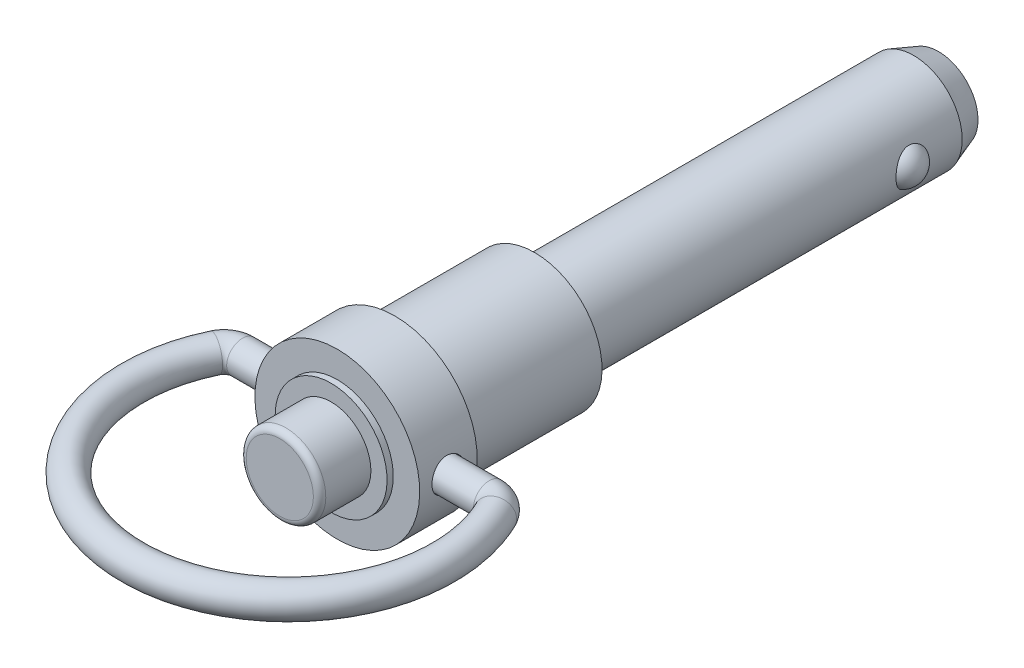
ISO-10303-21;
HEADER;
FILE_DESCRIPTION(('STEP AP214'),'2;1');
FILE_NAME('part.step','',(''),(''),'','','');
FILE_SCHEMA(('AUTOMOTIVE_DESIGN { 1 0 10303 214 1 1 1 1 }'));
ENDSEC;
DATA;
#1=APPLICATION_CONTEXT('core data for automotive mechanical design processes');
#2=APPLICATION_PROTOCOL_DEFINITION('international standard','automotive_design',2000,#1);
#3=PRODUCT_CONTEXT('',#1,'mechanical');
#4=PRODUCT('Part','Part','',(#3));
#5=PRODUCT_RELATED_PRODUCT_CATEGORY('part','',(#4));
#6=PRODUCT_DEFINITION_FORMATION('','',#4);
#7=PRODUCT_DEFINITION_CONTEXT('part definition',#1,'design');
#8=PRODUCT_DEFINITION('design','',#6,#7);
#9=PRODUCT_DEFINITION_SHAPE('','',#8);
#10=(LENGTH_UNIT() NAMED_UNIT(*) SI_UNIT(.MILLI.,.METRE.));
#11=(NAMED_UNIT(*) PLANE_ANGLE_UNIT() SI_UNIT($,.RADIAN.));
#12=(NAMED_UNIT(*) SI_UNIT($,.STERADIAN.) SOLID_ANGLE_UNIT());
#13=UNCERTAINTY_MEASURE_WITH_UNIT(LENGTH_MEASURE(1.E-05),#10,'distance_accuracy_value','');
#14=(GEOMETRIC_REPRESENTATION_CONTEXT(3) GLOBAL_UNCERTAINTY_ASSIGNED_CONTEXT((#13)) GLOBAL_UNIT_ASSIGNED_CONTEXT((#10,
#11,#12)) REPRESENTATION_CONTEXT('',''));
#15=CARTESIAN_POINT('',(0.,0.,0.));
#16=DIRECTION('',(0.,0.,1.));
#17=DIRECTION('',(1.,0.,0.));
#18=AXIS2_PLACEMENT_3D('',#15,#16,#17);
#19=CARTESIAN_POINT('',(5.7785,0.,11.43));
#20=DIRECTION('',(0.,0.,-1.));
#21=DIRECTION('',(0.,1.,0.));
#22=AXIS2_PLACEMENT_3D('',#19,#20,#21);
#23=PLANE('',#22);
#24=CARTESIAN_POINT('',(0.,0.,11.43));
#25=DIRECTION('',(0.,0.,-1.));
#26=DIRECTION('',(0.,1.,0.));
#27=AXIS2_PLACEMENT_3D('',#24,#25,#26);
#28=CIRCLE('',#27,5.9);
#29=CARTESIAN_POINT('',(0.,5.9,11.43));
#30=VERTEX_POINT('',#29);
#31=EDGE_CURVE('E23',#30,#30,#28,.F.);
#32=ORIENTED_EDGE('',*,*,#31,.T.);
#33=EDGE_LOOP('',(#32));
#34=FACE_BOUND('',#33,.T.);
#35=CARTESIAN_POINT('',(0.,0.,11.43));
#36=DIRECTION('',(0.,0.,-1.));
#37=DIRECTION('',(0.,1.,0.));
#38=AXIS2_PLACEMENT_3D('',#35,#36,#37);
#39=CIRCLE('',#38,6.731);
#40=CARTESIAN_POINT('',(0.,6.731,11.43));
#41=VERTEX_POINT('',#40);
#42=EDGE_CURVE('E120',#41,#41,#39,.T.);
#43=ORIENTED_EDGE('',*,*,#42,.T.);
#44=EDGE_LOOP('',(#43));
#45=FACE_BOUND('',#44,.T.);
#46=ADVANCED_FACE('F15',(#34,#45),#23,.T.);
#47=CARTESIAN_POINT('',(0.,0.,20.828));
#48=DIRECTION('',(0.,0.,1.));
#49=DIRECTION('',(0.,-1.,0.));
#50=AXIS2_PLACEMENT_3D('',#47,#48,#49);
#51=PLANE('',#50);
#52=CARTESIAN_POINT('',(0.,0.,20.828));
#53=DIRECTION('',(0.,0.,-1.));
#54=DIRECTION('',(0.,1.,0.));
#55=AXIS2_PLACEMENT_3D('',#52,#53,#54);
#56=CIRCLE('',#55,2.7432);
#57=CARTESIAN_POINT('',(0.,2.7432,20.828));
#58=VERTEX_POINT('',#57);
#59=CARTESIAN_POINT('',(0.,-2.7432,20.828));
#60=VERTEX_POINT('',#59);
#61=EDGE_CURVE('E36',#58,#60,#56,.T.);
#62=ORIENTED_EDGE('',*,*,#61,.F.);
#63=CARTESIAN_POINT('',(0.,0.,20.828));
#64=DIRECTION('',(0.,0.,-1.));
#65=DIRECTION('',(0.,-1.,0.));
#66=AXIS2_PLACEMENT_3D('',#63,#64,#65);
#67=CIRCLE('',#66,2.7432);
#68=EDGE_CURVE('E29',#60,#58,#67,.T.);
#69=ORIENTED_EDGE('',*,*,#68,.F.);
#70=EDGE_LOOP('',(#62,#69));
#71=FACE_BOUND('',#70,.T.);
#72=ADVANCED_FACE('F42',(#71),#51,.T.);
#73=CARTESIAN_POINT('',(0.,0.,20.1422));
#74=DIRECTION('',(0.,1.,0.));
#75=DIRECTION('',(-1.,0.,0.));
#76=AXIS2_PLACEMENT_3D('',#73,#74,#75);
#77=TOROIDAL_SURFACE('',#76,12.7,1.2954);
#78=CARTESIAN_POINT('',(-11.4549005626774,0.,14.6581090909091));
#79=DIRECTION('',(-0.43181818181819,0.,0.901960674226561));
#80=DIRECTION('',(-0.901960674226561,0.,-0.43181818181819));
#81=AXIS2_PLACEMENT_3D('',#78,#79,#80);
#82=CIRCLE('',#81,1.2954);
#83=CARTESIAN_POINT('',(-12.6233004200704,0.,14.0987318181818));
#84=VERTEX_POINT('',#83);
#85=EDGE_CURVE('E109',#84,#84,#82,.F.);
#86=ORIENTED_EDGE('',*,*,#85,.F.);
#87=EDGE_LOOP('',(#86));
#88=FACE_BOUND('',#87,.T.);
#89=CARTESIAN_POINT('',(11.4549005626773,0.,14.658109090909));
#90=DIRECTION('',(-0.431818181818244,0.,-0.901960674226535));
#91=DIRECTION('',(0.901960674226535,0.,-0.431818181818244));
#92=AXIS2_PLACEMENT_3D('',#89,#90,#91);
#93=CIRCLE('',#92,1.2954);
#94=CARTESIAN_POINT('',(12.6233004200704,0.,14.0987318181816));
#95=VERTEX_POINT('',#94);
#96=EDGE_CURVE('E43',#95,#95,#93,.T.);
#97=ORIENTED_EDGE('',*,*,#96,.F.);
#98=EDGE_LOOP('',(#97));
#99=FACE_BOUND('',#98,.T.);
#100=ADVANCED_FACE('F61',(#88,#99),#77,.T.);
#101=CARTESIAN_POINT('',(0.,0.,20.32));
#102=DIRECTION('',(0.,0.,1.));
#103=DIRECTION('',(0.,-1.,0.));
#104=AXIS2_PLACEMENT_3D('',#101,#102,#103);
#105=TOROIDAL_SURFACE('',#104,2.7432,0.508);
#106=ORIENTED_EDGE('',*,*,#68,.T.);
#107=ORIENTED_EDGE('',*,*,#61,.T.);
#108=EDGE_LOOP('',(#106,#107));
#109=FACE_BOUND('',#108,.T.);
#110=CARTESIAN_POINT('',(0.,0.,20.32));
#111=DIRECTION('',(0.,0.,-1.));
#112=DIRECTION('',(0.,1.,0.));
#113=AXIS2_PLACEMENT_3D('',#110,#111,#112);
#114=CIRCLE('',#113,3.2512);
#115=CARTESIAN_POINT('',(0.,3.2512,20.32));
#116=VERTEX_POINT('',#115);
#117=EDGE_CURVE('E112',#116,#116,#114,.T.);
#118=ORIENTED_EDGE('',*,*,#117,.F.);
#119=EDGE_LOOP('',(#118));
#120=FACE_BOUND('',#119,.T.);
#121=ADVANCED_FACE('F34',(#109,#120),#105,.T.);
#122=CARTESIAN_POINT('',(10.0803124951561,0.,15.3162));
#123=DIRECTION('',(0.,1.,0.));
#124=DIRECTION('',(-1.,0.,0.));
#125=AXIS2_PLACEMENT_3D('',#122,#123,#124);
#126=TOROIDAL_SURFACE('',#125,1.524,1.2954);
#127=ORIENTED_EDGE('',*,*,#96,.T.);
#128=EDGE_LOOP('',(#127));
#129=FACE_BOUND('',#128,.T.);
#130=CARTESIAN_POINT('',(10.0803124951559,0.,13.7922));
#131=DIRECTION('',(1.,0.,0.));
#132=DIRECTION('',(0.,1.,0.));
#133=AXIS2_PLACEMENT_3D('',#130,#131,#132);
#134=CIRCLE('',#133,1.2954);
#135=CARTESIAN_POINT('',(10.0803124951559,1.2954,13.7922));
#136=VERTEX_POINT('',#135);
#137=EDGE_CURVE('E106',#136,#136,#134,.F.);
#138=ORIENTED_EDGE('',*,*,#137,.F.);
#139=EDGE_LOOP('',(#138));
#140=FACE_BOUND('',#139,.T.);
#141=ADVANCED_FACE('F85',(#129,#140),#126,.T.);
#142=CARTESIAN_POINT('',(-10.0803124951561,0.,15.3162));
#143=DIRECTION('',(0.,1.,0.));
#144=DIRECTION('',(-1.,0.,0.));
#145=AXIS2_PLACEMENT_3D('',#142,#143,#144);
#146=TOROIDAL_SURFACE('',#145,1.524,1.2954);
#147=CARTESIAN_POINT('',(-10.0803124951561,0.,13.7922));
#148=DIRECTION('',(1.,0.,0.));
#149=DIRECTION('',(0.,1.,0.));
#150=AXIS2_PLACEMENT_3D('',#147,#148,#149);
#151=CIRCLE('',#150,1.2954);
#152=CARTESIAN_POINT('',(-10.0803124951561,1.2954,13.7922));
#153=VERTEX_POINT('',#152);
#154=EDGE_CURVE('E101',#153,#153,#151,.T.);
#155=ORIENTED_EDGE('',*,*,#154,.F.);
#156=EDGE_LOOP('',(#155));
#157=FACE_BOUND('',#156,.T.);
#158=ORIENTED_EDGE('',*,*,#85,.T.);
#159=EDGE_LOOP('',(#158));
#160=FACE_BOUND('',#159,.T.);
#161=ADVANCED_FACE('F88',(#157,#160),#146,.T.);
#162=CARTESIAN_POINT('',(0.,0.,20.828));
#163=DIRECTION('',(0.,0.,-1.));
#164=DIRECTION('',(0.,1.,0.));
#165=AXIS2_PLACEMENT_3D('',#162,#163,#164);
#166=CYLINDRICAL_SURFACE('',#165,3.2512);
#167=CARTESIAN_POINT('',(0.,0.,16.637));
#168=DIRECTION('',(0.,0.,-1.));
#169=DIRECTION('',(0.,1.,0.));
#170=AXIS2_PLACEMENT_3D('',#167,#168,#169);
#171=CIRCLE('',#170,3.2512);
#172=CARTESIAN_POINT('',(0.,3.2512,16.637));
#173=VERTEX_POINT('',#172);
#174=EDGE_CURVE('E105',#173,#173,#171,.T.);
#175=ORIENTED_EDGE('',*,*,#174,.F.);
#176=EDGE_LOOP('',(#175));
#177=FACE_BOUND('',#176,.T.);
#178=ORIENTED_EDGE('',*,*,#117,.T.);
#179=EDGE_LOOP('',(#178));
#180=FACE_BOUND('',#179,.T.);
#181=ADVANCED_FACE('F90',(#177,#180),#166,.T.);
#182=CARTESIAN_POINT('',(-10.0803124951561,0.,13.7922));
#183=DIRECTION('',(1.,0.,0.));
#184=DIRECTION('',(0.,1.,0.));
#185=AXIS2_PLACEMENT_3D('',#182,#183,#184);
#186=CYLINDRICAL_SURFACE('',#185,1.2954);
#187=CARTESIAN_POINT('',(4.953,0.,13.7922));
#188=DIRECTION('',(1.,0.,0.));
#189=DIRECTION('',(0.,1.,0.));
#190=AXIS2_PLACEMENT_3D('',#187,#188,#189);
#191=CIRCLE('',#190,1.2954);
#192=CARTESIAN_POINT('',(4.953,1.2954,13.7922));
#193=VERTEX_POINT('',#192);
#194=EDGE_CURVE('E104',#193,#193,#191,.F.);
#195=ORIENTED_EDGE('',*,*,#194,.F.);
#196=EDGE_LOOP('',(#195));
#197=FACE_BOUND('',#196,.T.);
#198=ORIENTED_EDGE('',*,*,#137,.T.);
#199=EDGE_LOOP('',(#198));
#200=FACE_BOUND('',#199,.T.);
#201=ADVANCED_FACE('F93',(#197,#200),#186,.T.);
#202=CARTESIAN_POINT('',(-10.0803124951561,0.,13.7922));
#203=DIRECTION('',(1.,0.,0.));
#204=DIRECTION('',(0.,1.,0.));
#205=AXIS2_PLACEMENT_3D('',#202,#203,#204);
#206=CYLINDRICAL_SURFACE('',#205,1.2954);
#207=CARTESIAN_POINT('',(-4.953,0.,13.7922));
#208=DIRECTION('',(1.,0.,0.));
#209=DIRECTION('',(0.,1.,0.));
#210=AXIS2_PLACEMENT_3D('',#207,#208,#209);
#211=CIRCLE('',#210,1.2954);
#212=CARTESIAN_POINT('',(-4.953,1.2954,13.7922));
#213=VERTEX_POINT('',#212);
#214=EDGE_CURVE('E193',#213,#213,#211,.T.);
#215=ORIENTED_EDGE('',*,*,#214,.F.);
#216=EDGE_LOOP('',(#215));
#217=FACE_BOUND('',#216,.T.);
#218=ORIENTED_EDGE('',*,*,#154,.T.);
#219=EDGE_LOOP('',(#218));
#220=FACE_BOUND('',#219,.T.);
#221=ADVANCED_FACE('F239',(#217,#220),#206,.T.);
#222=CARTESIAN_POINT('',(4.572,0.,16.637));
#223=DIRECTION('',(0.,0.,1.));
#224=DIRECTION('',(0.,-1.,0.));
#225=AXIS2_PLACEMENT_3D('',#222,#223,#224);
#226=PLANE('',#225);
#227=ORIENTED_EDGE('',*,*,#174,.T.);
#228=EDGE_LOOP('',(#227));
#229=FACE_BOUND('',#228,.T.);
#230=CARTESIAN_POINT('',(0.,0.,16.637));
#231=DIRECTION('',(0.,0.,-1.));
#232=DIRECTION('',(0.,1.,0.));
#233=AXIS2_PLACEMENT_3D('',#230,#231,#232);
#234=CIRCLE('',#233,4.572);
#235=CARTESIAN_POINT('',(0.,4.572,16.637));
#236=VERTEX_POINT('',#235);
#237=EDGE_CURVE('E197',#236,#236,#234,.T.);
#238=ORIENTED_EDGE('',*,*,#237,.F.);
#239=EDGE_LOOP('',(#238));
#240=FACE_BOUND('',#239,.T.);
#241=ADVANCED_FACE('F206',(#229,#240),#226,.T.);
#242=CARTESIAN_POINT('',(4.953,0.,13.7922));
#243=DIRECTION('',(1.,0.,0.));
#244=DIRECTION('',(0.,1.,0.));
#245=AXIS2_PLACEMENT_3D('',#242,#243,#244);
#246=PLANE('',#245);
#247=CARTESIAN_POINT('',(4.953,0.,13.7922));
#248=DIRECTION('',(1.,0.,0.));
#249=DIRECTION('',(0.,1.,0.));
#250=AXIS2_PLACEMENT_3D('',#247,#248,#249);
#251=CIRCLE('',#250,1.3335);
#252=CARTESIAN_POINT('',(4.953,1.3335,13.7922));
#253=VERTEX_POINT('',#252);
#254=EDGE_CURVE('E190',#253,#253,#251,.T.);
#255=ORIENTED_EDGE('',*,*,#254,.T.);
#256=EDGE_LOOP('',(#255));
#257=FACE_BOUND('',#256,.T.);
#258=ORIENTED_EDGE('',*,*,#194,.T.);
#259=EDGE_LOOP('',(#258));
#260=FACE_BOUND('',#259,.T.);
#261=ADVANCED_FACE('F249',(#257,#260),#246,.T.);
#262=CARTESIAN_POINT('',(-4.953,0.,13.7922));
#263=DIRECTION('',(-1.,0.,0.));
#264=DIRECTION('',(0.,-1.,0.));
#265=AXIS2_PLACEMENT_3D('',#262,#263,#264);
#266=PLANE('',#265);
#267=CARTESIAN_POINT('',(-4.953,0.,13.7922));
#268=DIRECTION('',(-1.,0.,0.));
#269=DIRECTION('',(0.,-1.,0.));
#270=AXIS2_PLACEMENT_3D('',#267,#268,#269);
#271=CIRCLE('',#270,1.3335);
#272=CARTESIAN_POINT('',(-4.95299999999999,-1.33350000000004,13.7922));
#273=VERTEX_POINT('',#272);
#274=EDGE_CURVE('E157',#273,#273,#271,.T.);
#275=ORIENTED_EDGE('',*,*,#274,.T.);
#276=EDGE_LOOP('',(#275));
#277=FACE_BOUND('',#276,.T.);
#278=ORIENTED_EDGE('',*,*,#214,.T.);
#279=EDGE_LOOP('',(#278));
#280=FACE_BOUND('',#279,.T.);
#281=ADVANCED_FACE('F165',(#277,#280),#266,.T.);
#282=CARTESIAN_POINT('',(0.,0.,0.));
#283=DIRECTION('',(0.,0.,-1.));
#284=DIRECTION('',(0.,1.,0.));
#285=AXIS2_PLACEMENT_3D('',#282,#283,#284);
#286=CYLINDRICAL_SURFACE('',#285,4.572);
#287=ORIENTED_EDGE('',*,*,#237,.T.);
#288=EDGE_LOOP('',(#287));
#289=FACE_BOUND('',#288,.T.);
#290=CARTESIAN_POINT('',(0.,0.,16.129));
#291=DIRECTION('',(0.,0.,-1.));
#292=DIRECTION('',(0.,1.,0.));
#293=AXIS2_PLACEMENT_3D('',#290,#291,#292);
#294=CIRCLE('',#293,4.572);
#295=CARTESIAN_POINT('',(0.,4.572,16.129));
#296=VERTEX_POINT('',#295);
#297=EDGE_CURVE('E192',#296,#296,#294,.T.);
#298=ORIENTED_EDGE('',*,*,#297,.F.);
#299=EDGE_LOOP('',(#298));
#300=FACE_BOUND('',#299,.T.);
#301=ADVANCED_FACE('F163',(#289,#300),#286,.T.);
#302=CARTESIAN_POINT('',(4.953,0.,13.7922));
#303=DIRECTION('',(1.,0.,0.));
#304=DIRECTION('',(0.,1.,0.));
#305=AXIS2_PLACEMENT_3D('',#302,#303,#304);
#306=CYLINDRICAL_SURFACE('',#305,1.3335);
#307=CARTESIAN_POINT('',(6.59758582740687,1.3335,13.7922));
#308=CARTESIAN_POINT('',(6.59758765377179,1.333496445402,13.718166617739));
#309=CARTESIAN_POINT('',(6.59884669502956,1.3273080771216,13.6440410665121));
#310=CARTESIAN_POINT('',(6.60374356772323,1.30272126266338,13.4978267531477));
#311=CARTESIAN_POINT('',(6.60738612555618,1.28429855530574,13.4257423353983));
#312=CARTESIAN_POINT('',(6.61662138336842,1.23583426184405,13.28583488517));
#313=CARTESIAN_POINT('',(6.622211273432,1.20580941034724,13.2180058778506));
#314=CARTESIAN_POINT('',(6.63470762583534,1.13503345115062,13.0883707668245));
#315=CARTESIAN_POINT('',(6.64161365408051,1.09428587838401,13.0265626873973));
#316=CARTESIAN_POINT('',(6.6560731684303,1.00260929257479,12.9098323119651));
#317=CARTESIAN_POINT('',(6.66363369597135,0.951558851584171,12.8550062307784));
#318=CARTESIAN_POINT('',(6.6784886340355,0.840985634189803,12.7546347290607));
#319=CARTESIAN_POINT('',(6.68578301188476,0.781461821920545,12.7090904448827));
#320=CARTESIAN_POINT('',(6.69935837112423,0.655004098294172,12.6282103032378));
#321=CARTESIAN_POINT('',(6.70563018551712,0.588011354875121,12.5929647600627));
#322=CARTESIAN_POINT('',(6.7163755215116,0.448910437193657,12.5342656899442));
#323=CARTESIAN_POINT('',(6.72084922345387,0.376802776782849,12.5108109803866));
#324=CARTESIAN_POINT('',(6.72744504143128,0.230507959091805,12.4766555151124));
#325=CARTESIAN_POINT('',(6.72959681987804,0.156359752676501,12.4657937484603));
#326=CARTESIAN_POINT('',(6.73140875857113,0.00726425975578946,12.4566302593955));
#327=CARTESIAN_POINT('',(6.73106915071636,-0.0676829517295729,12.4583273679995));
#328=CARTESIAN_POINT('',(6.72795960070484,-0.215142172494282,12.4741110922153));
#329=CARTESIAN_POINT('',(6.72522369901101,-0.287673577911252,12.4880241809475));
#330=CARTESIAN_POINT('',(6.71766729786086,-0.429351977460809,12.5275699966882));
#331=CARTESIAN_POINT('',(6.71284670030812,-0.498498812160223,12.5532032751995));
#332=CARTESIAN_POINT('',(6.701606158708,-0.631943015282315,12.6156242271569));
#333=CARTESIAN_POINT('',(6.69517643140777,-0.696207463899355,12.6524804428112));
#334=CARTESIAN_POINT('',(6.68142742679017,-0.817699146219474,12.7362475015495));
#335=CARTESIAN_POINT('',(6.67410811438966,-0.874926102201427,12.7831587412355));
#336=CARTESIAN_POINT('',(6.65924190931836,-0.981743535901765,12.8866477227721));
#337=CARTESIAN_POINT('',(6.65169326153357,-1.03118836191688,12.9433756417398));
#338=CARTESIAN_POINT('',(6.63733339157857,-1.11990778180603,13.06442219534));
#339=CARTESIAN_POINT('',(6.63052249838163,-1.1591778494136,13.1287441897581));
#340=CARTESIAN_POINT('',(6.61840508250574,-1.22647971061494,13.2633777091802));
#341=CARTESIAN_POINT('',(6.61310290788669,-1.25447911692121,13.3337058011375));
#342=CARTESIAN_POINT('',(6.60466715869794,-1.29816626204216,13.4781072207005));
#343=CARTESIAN_POINT('',(6.6015290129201,-1.31387996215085,13.5521722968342));
#344=CARTESIAN_POINT('',(6.59896792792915,-1.32664627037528,13.6543666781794));
#345=CARTESIAN_POINT('',(6.59845085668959,-1.3292142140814,13.6818643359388));
#346=CARTESIAN_POINT('',(6.59775946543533,-1.33264174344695,13.7369703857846));
#347=CARTESIAN_POINT('',(6.59758514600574,-1.33350132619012,13.7645787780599));
#348=CARTESIAN_POINT('',(6.59758765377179,-1.333496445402,13.866233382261));
#349=CARTESIAN_POINT('',(6.59884669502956,-1.3273080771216,13.9403589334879));
#350=CARTESIAN_POINT('',(6.60374356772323,-1.30272126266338,14.0865732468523));
#351=CARTESIAN_POINT('',(6.60738612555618,-1.28429855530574,14.1586576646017));
#352=CARTESIAN_POINT('',(6.61662138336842,-1.23583426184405,14.29856511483));
#353=CARTESIAN_POINT('',(6.622211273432,-1.20580941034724,14.3663941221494));
#354=CARTESIAN_POINT('',(6.63470762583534,-1.13503345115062,14.4960292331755));
#355=CARTESIAN_POINT('',(6.64161365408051,-1.09428587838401,14.5578373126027));
#356=CARTESIAN_POINT('',(6.6560731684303,-1.00260929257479,14.6745676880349));
#357=CARTESIAN_POINT('',(6.66363369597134,-0.951558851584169,14.7293937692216));
#358=CARTESIAN_POINT('',(6.6784886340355,-0.840985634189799,14.8297652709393));
#359=CARTESIAN_POINT('',(6.68578301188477,-0.781461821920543,14.8753095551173));
#360=CARTESIAN_POINT('',(6.69935837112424,-0.65500409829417,14.9561896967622));
#361=CARTESIAN_POINT('',(6.70563018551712,-0.588011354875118,14.9914352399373));
#362=CARTESIAN_POINT('',(6.7163755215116,-0.448910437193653,15.0501343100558));
#363=CARTESIAN_POINT('',(6.72084922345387,-0.376802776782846,15.0735890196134));
#364=CARTESIAN_POINT('',(6.72744504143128,-0.230507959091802,15.1077444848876));
#365=CARTESIAN_POINT('',(6.72959681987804,-0.156359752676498,15.1186062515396));
#366=CARTESIAN_POINT('',(6.73140875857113,-0.00726425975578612,15.1277697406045));
#367=CARTESIAN_POINT('',(6.73106915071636,0.0676829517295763,15.1260726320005));
#368=CARTESIAN_POINT('',(6.72795960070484,0.215142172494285,15.1102889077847));
#369=CARTESIAN_POINT('',(6.72522369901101,0.287673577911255,15.0963758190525));
#370=CARTESIAN_POINT('',(6.71766729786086,0.429351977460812,15.0568300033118));
#371=CARTESIAN_POINT('',(6.71284670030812,0.498498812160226,15.0311967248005));
#372=CARTESIAN_POINT('',(6.701606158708,0.631943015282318,14.9687757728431));
#373=CARTESIAN_POINT('',(6.69517643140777,0.696207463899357,14.9319195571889));
#374=CARTESIAN_POINT('',(6.68142742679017,0.817699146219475,14.8481524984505));
#375=CARTESIAN_POINT('',(6.67410811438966,0.874926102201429,14.8012412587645));
#376=CARTESIAN_POINT('',(6.65924190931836,0.981743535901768,14.6977522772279));
#377=CARTESIAN_POINT('',(6.65169326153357,1.03118836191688,14.6410243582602));
#378=CARTESIAN_POINT('',(6.63733339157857,1.11990778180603,14.51997780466));
#379=CARTESIAN_POINT('',(6.63052249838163,1.1591778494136,14.4556558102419));
#380=CARTESIAN_POINT('',(6.61840508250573,1.22647971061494,14.3210222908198));
#381=CARTESIAN_POINT('',(6.61310290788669,1.25447911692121,14.2506941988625));
#382=CARTESIAN_POINT('',(6.60466715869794,1.29816626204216,14.1062927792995));
#383=CARTESIAN_POINT('',(6.6015290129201,1.31387996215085,14.0322277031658));
#384=CARTESIAN_POINT('',(6.59896792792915,1.32664627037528,13.9300333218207));
#385=CARTESIAN_POINT('',(6.59845085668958,1.3292142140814,13.9025356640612));
#386=CARTESIAN_POINT('',(6.59775946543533,1.33264174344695,13.8474296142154));
#387=CARTESIAN_POINT('',(6.59758514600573,1.33350132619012,13.8198212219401));
#388=CARTESIAN_POINT('',(6.59758582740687,1.3335,13.7922));
#389=B_SPLINE_CURVE_WITH_KNOTS('',3,(#307,#308,#309,#310,#311,#312,#313,#314,#315,#316,#317,
#318,#319,#320,#321,#322,#323,#324,#325,#326,#327,#328,#329,#330,#331,#332,#333,#334,#335,#336,
#337,#338,#339,#340,#341,#342,#343,#344,#345,#346,#347,#348,#349,#350,#351,#352,#353,#354,#355,
#356,#357,#358,#359,#360,#361,#362,#363,#364,#365,#366,#367,#368,#369,#370,#371,#372,#373,#374,
#375,#376,#377,#378,#379,#380,#381,#382,#383,#384,#385,#386,#387,#388),.UNSPECIFIED.,.T.,.F.,(4,
2,2,2,2,2,2,2,2,2,2,2,2,2,2,2,2,2,2,2,2,2,2,2,2,2,2,2,2,2,2,2,2,2,2,2,2,2,2,2,4),(0.,
0.221994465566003,0.444430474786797,0.666546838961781,0.888590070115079,1.11342160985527,
1.33828065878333,1.56505617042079,1.79180893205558,2.01562934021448,2.23942891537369,
2.46009995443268,2.68078137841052,2.90283856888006,3.12490451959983,3.35072919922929,
3.5766541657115,3.80322379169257,4.02931334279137,4.11213743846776,4.19496167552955,
4.41695614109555,4.63939215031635,4.86150851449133,5.08355174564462,5.30838328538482,
5.53324233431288,5.76001784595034,5.98677060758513,6.21059101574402,6.43439059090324,
6.65506162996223,6.87574305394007,7.09780024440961,7.31986619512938,7.54569087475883,
7.77161584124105,7.99818546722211,8.22427501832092,8.30709911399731,8.38992335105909),.UNSPECIFIED.);
#390=CARTESIAN_POINT('',(6.59758582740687,1.3335,13.7922));
#391=VERTEX_POINT('',#390);
#392=EDGE_CURVE('E150',#391,#391,#389,.T.);
#393=ORIENTED_EDGE('',*,*,#392,.F.);
#394=EDGE_LOOP('',(#393));
#395=FACE_BOUND('',#394,.T.);
#396=ORIENTED_EDGE('',*,*,#254,.F.);
#397=EDGE_LOOP('',(#396));
#398=FACE_BOUND('',#397,.T.);
#399=ADVANCED_FACE('F159',(#395,#398),#306,.F.);
#400=CARTESIAN_POINT('',(-4.953,0.,13.7922));
#401=DIRECTION('',(-1.,0.,0.));
#402=DIRECTION('',(0.,-1.,0.));
#403=AXIS2_PLACEMENT_3D('',#400,#401,#402);
#404=CYLINDRICAL_SURFACE('',#403,1.3335);
#405=CARTESIAN_POINT('',(-6.59758582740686,-1.33350000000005,13.7922));
#406=CARTESIAN_POINT('',(-6.59758765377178,-1.33349644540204,13.718166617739));
#407=CARTESIAN_POINT('',(-6.59884669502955,-1.32730807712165,13.6440410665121));
#408=CARTESIAN_POINT('',(-6.60374356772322,-1.30272126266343,13.4978267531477));
#409=CARTESIAN_POINT('',(-6.60738612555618,-1.28429855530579,13.4257423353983));
#410=CARTESIAN_POINT('',(-6.61662138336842,-1.2358342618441,13.28583488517));
#411=CARTESIAN_POINT('',(-6.62221127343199,-1.20580941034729,13.2180058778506));
#412=CARTESIAN_POINT('',(-6.63470762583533,-1.13503345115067,13.0883707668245));
#413=CARTESIAN_POINT('',(-6.64161365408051,-1.09428587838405,13.0265626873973));
#414=CARTESIAN_POINT('',(-6.6560731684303,-1.00260929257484,12.9098323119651));
#415=CARTESIAN_POINT('',(-6.66363369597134,-0.951558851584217,12.8550062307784));
#416=CARTESIAN_POINT('',(-6.67848863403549,-0.840985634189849,12.7546347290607));
#417=CARTESIAN_POINT('',(-6.68578301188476,-0.781461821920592,12.7090904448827));
#418=CARTESIAN_POINT('',(-6.69935837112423,-0.655004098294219,12.6282103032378));
#419=CARTESIAN_POINT('',(-6.70563018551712,-0.588011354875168,12.5929647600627));
#420=CARTESIAN_POINT('',(-6.71637552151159,-0.448910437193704,12.5342656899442));
#421=CARTESIAN_POINT('',(-6.72084922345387,-0.376802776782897,12.5108109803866));
#422=CARTESIAN_POINT('',(-6.72744504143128,-0.230507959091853,12.4766555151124));
#423=CARTESIAN_POINT('',(-6.72959681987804,-0.156359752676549,12.4657937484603));
#424=CARTESIAN_POINT('',(-6.73140875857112,-0.00726425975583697,12.4566302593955));
#425=CARTESIAN_POINT('',(-6.73106915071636,0.0676829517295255,12.4583273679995));
#426=CARTESIAN_POINT('',(-6.72795960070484,0.215142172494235,12.4741110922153));
#427=CARTESIAN_POINT('',(-6.72522369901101,0.287673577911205,12.4880241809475));
#428=CARTESIAN_POINT('',(-6.71766729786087,0.429351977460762,12.5275699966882));
#429=CARTESIAN_POINT('',(-6.71284670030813,0.498498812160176,12.5532032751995));
#430=CARTESIAN_POINT('',(-6.70160615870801,0.631943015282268,12.6156242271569));
#431=CARTESIAN_POINT('',(-6.69517643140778,0.696207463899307,12.6524804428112));
#432=CARTESIAN_POINT('',(-6.68142742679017,0.817699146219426,12.7362475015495));
#433=CARTESIAN_POINT('',(-6.67410811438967,0.87492610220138,12.7831587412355));
#434=CARTESIAN_POINT('',(-6.65924190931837,0.981743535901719,12.8866477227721));
#435=CARTESIAN_POINT('',(-6.65169326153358,1.03118836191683,12.9433756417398));
#436=CARTESIAN_POINT('',(-6.63733339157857,1.11990778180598,13.06442219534));
#437=CARTESIAN_POINT('',(-6.63052249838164,1.15917784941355,13.1287441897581));
#438=CARTESIAN_POINT('',(-6.61840508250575,1.22647971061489,13.2633777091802));
#439=CARTESIAN_POINT('',(-6.6131029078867,1.25447911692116,13.3337058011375));
#440=CARTESIAN_POINT('',(-6.60466715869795,1.29816626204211,13.4781072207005));
#441=CARTESIAN_POINT('',(-6.60152901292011,1.3138799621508,13.5521722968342));
#442=CARTESIAN_POINT('',(-6.59896792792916,1.32664627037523,13.6543666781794));
#443=CARTESIAN_POINT('',(-6.59845085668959,1.32921421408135,13.6818643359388));
#444=CARTESIAN_POINT('',(-6.59775946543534,1.33264174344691,13.7369703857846));
#445=CARTESIAN_POINT('',(-6.59758514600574,1.33350132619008,13.7645787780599));
#446=CARTESIAN_POINT('',(-6.5975876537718,1.33349644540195,13.866233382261));
#447=CARTESIAN_POINT('',(-6.59884669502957,1.32730807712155,13.9403589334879));
#448=CARTESIAN_POINT('',(-6.60374356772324,1.30272126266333,14.0865732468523));
#449=CARTESIAN_POINT('',(-6.60738612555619,1.28429855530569,14.1586576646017));
#450=CARTESIAN_POINT('',(-6.61662138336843,1.235834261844,14.29856511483));
#451=CARTESIAN_POINT('',(-6.62221127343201,1.20580941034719,14.3663941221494));
#452=CARTESIAN_POINT('',(-6.63470762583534,1.13503345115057,14.4960292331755));
#453=CARTESIAN_POINT('',(-6.64161365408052,1.09428587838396,14.5578373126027));
#454=CARTESIAN_POINT('',(-6.65607316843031,1.00260929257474,14.6745676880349));
#455=CARTESIAN_POINT('',(-6.66363369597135,0.95155885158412,14.7293937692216));
#456=CARTESIAN_POINT('',(-6.67848863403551,0.840985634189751,14.8297652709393));
#457=CARTESIAN_POINT('',(-6.68578301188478,0.781461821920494,14.8753095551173));
#458=CARTESIAN_POINT('',(-6.69935837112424,0.655004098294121,14.9561896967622));
#459=CARTESIAN_POINT('',(-6.70563018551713,0.58801135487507,14.9914352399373));
#460=CARTESIAN_POINT('',(-6.7163755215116,0.448910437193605,15.0501343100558));
#461=CARTESIAN_POINT('',(-6.72084922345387,0.376802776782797,15.0735890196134));
#462=CARTESIAN_POINT('',(-6.72744504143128,0.230507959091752,15.1077444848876));
#463=CARTESIAN_POINT('',(-6.72959681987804,0.156359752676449,15.1186062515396));
#464=CARTESIAN_POINT('',(-6.73140875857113,0.00726425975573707,15.1277697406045));
#465=CARTESIAN_POINT('',(-6.73106915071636,-0.0676829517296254,15.1260726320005));
#466=CARTESIAN_POINT('',(-6.72795960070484,-0.215142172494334,15.1102889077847));
#467=CARTESIAN_POINT('',(-6.725223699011,-0.287673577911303,15.0963758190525));
#468=CARTESIAN_POINT('',(-6.71766729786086,-0.429351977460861,15.0568300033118));
#469=CARTESIAN_POINT('',(-6.71284670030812,-0.498498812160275,15.0311967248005));
#470=CARTESIAN_POINT('',(-6.701606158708,-0.631943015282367,14.9687757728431));
#471=CARTESIAN_POINT('',(-6.69517643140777,-0.696207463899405,14.9319195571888));
#472=CARTESIAN_POINT('',(-6.68142742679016,-0.817699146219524,14.8481524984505));
#473=CARTESIAN_POINT('',(-6.67410811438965,-0.874926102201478,14.8012412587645));
#474=CARTESIAN_POINT('',(-6.65924190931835,-0.981743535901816,14.6977522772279));
#475=CARTESIAN_POINT('',(-6.65169326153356,-1.03118836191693,14.6410243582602));
#476=CARTESIAN_POINT('',(-6.63733339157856,-1.11990778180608,14.51997780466));
#477=CARTESIAN_POINT('',(-6.63052249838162,-1.15917784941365,14.4556558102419));
#478=CARTESIAN_POINT('',(-6.61840508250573,-1.22647971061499,14.3210222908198));
#479=CARTESIAN_POINT('',(-6.61310290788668,-1.25447911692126,14.2506941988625));
#480=CARTESIAN_POINT('',(-6.60466715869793,-1.2981662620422,14.1062927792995));
#481=CARTESIAN_POINT('',(-6.60152901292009,-1.31387996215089,14.0322277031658));
#482=CARTESIAN_POINT('',(-6.59896792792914,-1.32664627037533,13.9300333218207));
#483=CARTESIAN_POINT('',(-6.59845085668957,-1.32921421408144,13.9025356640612));
#484=CARTESIAN_POINT('',(-6.59775946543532,-1.332641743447,13.8474296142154));
#485=CARTESIAN_POINT('',(-6.59758514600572,-1.33350132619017,13.8198212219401));
#486=CARTESIAN_POINT('',(-6.59758582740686,-1.33350000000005,13.7922));
#487=B_SPLINE_CURVE_WITH_KNOTS('',3,(#405,#406,#407,#408,#409,#410,#411,#412,#413,#414,#415,
#416,#417,#418,#419,#420,#421,#422,#423,#424,#425,#426,#427,#428,#429,#430,#431,#432,#433,#434,
#435,#436,#437,#438,#439,#440,#441,#442,#443,#444,#445,#446,#447,#448,#449,#450,#451,#452,#453,
#454,#455,#456,#457,#458,#459,#460,#461,#462,#463,#464,#465,#466,#467,#468,#469,#470,#471,#472,
#473,#474,#475,#476,#477,#478,#479,#480,#481,#482,#483,#484,#485,#486),.UNSPECIFIED.,.T.,.F.,(4,
2,2,2,2,2,2,2,2,2,2,2,2,2,2,2,2,2,2,2,2,2,2,2,2,2,2,2,2,2,2,2,2,2,2,2,2,2,2,2,4),(0.,
0.221994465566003,0.444430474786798,0.666546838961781,0.88859007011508,1.11342160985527,
1.33828065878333,1.56505617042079,1.79180893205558,2.01562934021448,2.23942891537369,
2.46009995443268,2.68078137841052,2.90283856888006,3.12490451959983,3.35072919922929,
3.5766541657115,3.80322379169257,4.02931334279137,4.11213743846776,4.19496167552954,
4.41695614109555,4.63939215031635,4.86150851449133,5.08355174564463,5.30838328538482,
5.53324233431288,5.76001784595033,5.98677060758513,6.21059101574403,6.43439059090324,
6.65506162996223,6.87574305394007,7.09780024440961,7.31986619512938,7.54569087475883,
7.77161584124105,7.99818546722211,8.22427501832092,8.30709911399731,8.38992335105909),.UNSPECIFIED.);
#488=CARTESIAN_POINT('',(-6.59758582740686,-1.33350000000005,13.7922));
#489=VERTEX_POINT('',#488);
#490=EDGE_CURVE('E129',#489,#489,#487,.T.);
#491=ORIENTED_EDGE('',*,*,#490,.F.);
#492=EDGE_LOOP('',(#491));
#493=FACE_BOUND('',#492,.T.);
#494=ORIENTED_EDGE('',*,*,#274,.F.);
#495=EDGE_LOOP('',(#494));
#496=FACE_BOUND('',#495,.T.);
#497=ADVANCED_FACE('F139',(#493,#496),#404,.F.);
#498=CARTESIAN_POINT('',(6.731,0.,16.129));
#499=DIRECTION('',(0.,0.,1.));
#500=DIRECTION('',(0.,-1.,0.));
#501=AXIS2_PLACEMENT_3D('',#498,#499,#500);
#502=PLANE('',#501);
#503=CARTESIAN_POINT('',(0.,0.,16.129));
#504=DIRECTION('',(0.,0.,-1.));
#505=DIRECTION('',(0.,1.,0.));
#506=AXIS2_PLACEMENT_3D('',#503,#504,#505);
#507=CIRCLE('',#506,6.731);
#508=CARTESIAN_POINT('',(0.,6.731,16.129));
#509=VERTEX_POINT('',#508);
#510=EDGE_CURVE('E137',#509,#509,#507,.T.);
#511=ORIENTED_EDGE('',*,*,#510,.F.);
#512=EDGE_LOOP('',(#511));
#513=FACE_BOUND('',#512,.T.);
#514=ORIENTED_EDGE('',*,*,#297,.T.);
#515=EDGE_LOOP('',(#514));
#516=FACE_BOUND('',#515,.T.);
#517=ADVANCED_FACE('F146',(#513,#516),#502,.T.);
#518=CARTESIAN_POINT('',(0.,0.,0.));
#519=DIRECTION('',(0.,0.,-1.));
#520=DIRECTION('',(0.,1.,0.));
#521=AXIS2_PLACEMENT_3D('',#518,#519,#520);
#522=CYLINDRICAL_SURFACE('',#521,6.731);
#523=ORIENTED_EDGE('',*,*,#510,.T.);
#524=EDGE_LOOP('',(#523));
#525=FACE_BOUND('',#524,.T.);
#526=ORIENTED_EDGE('',*,*,#490,.T.);
#527=EDGE_LOOP('',(#526));
#528=FACE_BOUND('',#527,.T.);
#529=ORIENTED_EDGE('',*,*,#42,.F.);
#530=EDGE_LOOP('',(#529));
#531=FACE_BOUND('',#530,.T.);
#532=ORIENTED_EDGE('',*,*,#392,.T.);
#533=EDGE_LOOP('',(#532));
#534=FACE_BOUND('',#533,.T.);
#535=ADVANCED_FACE('F142',(#525,#528,#531,#534),#522,.T.);
#536=CARTESIAN_POINT('',(0.,0.,37.0995373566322));
#537=DIRECTION('',(0.,0.,-1.));
#538=DIRECTION('',(0.,1.,0.));
#539=AXIS2_PLACEMENT_3D('',#536,#537,#538);
#540=CYLINDRICAL_SURFACE('',#539,5.5);
#541=CARTESIAN_POINT('',(0.,0.,11.03));
#542=DIRECTION('',(0.,0.,-1.));
#543=DIRECTION('',(0.,1.,0.));
#544=AXIS2_PLACEMENT_3D('',#541,#542,#543);
#545=CIRCLE('',#544,5.5);
#546=CARTESIAN_POINT('',(0.,5.5,11.03));
#547=VERTEX_POINT('',#546);
#548=EDGE_CURVE('E9',#547,#547,#545,.T.);
#549=ORIENTED_EDGE('',*,*,#548,.T.);
#550=EDGE_LOOP('',(#549));
#551=FACE_BOUND('',#550,.T.);
#552=CARTESIAN_POINT('',(0.,0.,0.));
#553=DIRECTION('',(0.,0.,-1.));
#554=DIRECTION('',(0.,1.,0.));
#555=AXIS2_PLACEMENT_3D('',#552,#553,#554);
#556=CIRCLE('',#555,5.5);
#557=CARTESIAN_POINT('',(0.,5.5,0.));
#558=VERTEX_POINT('',#557);
#559=EDGE_CURVE('E396',#558,#558,#556,.T.);
#560=ORIENTED_EDGE('',*,*,#559,.F.);
#561=EDGE_LOOP('',(#560));
#562=FACE_BOUND('',#561,.T.);
#563=ADVANCED_FACE('F62',(#551,#562),#540,.T.);
#564=CARTESIAN_POINT('',(3.22979748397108,0.,-32.9908));
#565=DIRECTION('',(0.,0.,1.));
#566=DIRECTION('',(0.,-1.,0.));
#567=AXIS2_PLACEMENT_3D('',#564,#565,#566);
#568=PLANE('',#567);
#569=CARTESIAN_POINT('',(0.,0.,-32.9907999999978));
#570=DIRECTION('',(0.,0.,1.));
#571=DIRECTION('',(0.,-1.,0.));
#572=AXIS2_PLACEMENT_3D('',#569,#570,#571);
#573=CIRCLE('',#572,3.22979748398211);
#574=CARTESIAN_POINT('',(0.,-3.22979748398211,-32.9907999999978));
#575=VERTEX_POINT('',#574);
#576=EDGE_CURVE('E46',#575,#575,#573,.T.);
#577=ORIENTED_EDGE('',*,*,#576,.F.);
#578=EDGE_LOOP('',(#577));
#579=FACE_BOUND('',#578,.T.);
#580=ADVANCED_FACE('F310',(#579),#568,.F.);
#581=CARTESIAN_POINT('',(3.12293,0.,-26.8948));
#582=DIRECTION('',(0.,0.,1.));
#583=DIRECTION('',(1.,0.,0.));
#584=AXIS2_PLACEMENT_3D('',#581,#582,#583);
#585=SPHERICAL_SURFACE('',#584,1.5875);
#586=CARTESIAN_POINT('',(3.969385,0.,-25.5517921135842));
#587=CARTESIAN_POINT('',(3.96938133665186,0.0871787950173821,-25.5517940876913));
#588=CARTESIAN_POINT('',(3.96648576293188,0.174428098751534,-25.5584820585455));
#589=CARTESIAN_POINT('',(3.95516905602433,0.346584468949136,-25.5851998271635));
#590=CARTESIAN_POINT('',(3.94674017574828,0.431488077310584,-25.6052483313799));
#591=CARTESIAN_POINT('',(3.92519423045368,0.596479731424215,-25.6585272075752));
#592=CARTESIAN_POINT('',(3.91207555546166,0.676566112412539,-25.6917621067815));
#593=CARTESIAN_POINT('',(3.88253654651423,0.829452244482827,-25.7710588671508));
#594=CARTESIAN_POINT('',(3.86611699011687,0.902253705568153,-25.8171177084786));
#595=CARTESIAN_POINT('',(3.83222363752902,1.03672093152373,-25.9203356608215));
#596=CARTESIAN_POINT('',(3.81477966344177,1.0985904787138,-25.9772380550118));
#597=CARTESIAN_POINT('',(3.78068495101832,1.21073548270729,-26.1017462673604));
#598=CARTESIAN_POINT('',(3.76403384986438,1.26101628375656,-26.1693471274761));
#599=CARTESIAN_POINT('',(3.73507217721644,1.34426479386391,-26.3077911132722));
#600=CARTESIAN_POINT('',(3.72252093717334,1.37829571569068,-26.3779422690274));
#601=CARTESIAN_POINT('',(3.70178973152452,1.43305274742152,-26.5238520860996));
#602=CARTESIAN_POINT('',(3.69360549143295,1.45379187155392,-26.5996051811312));
#603=CARTESIAN_POINT('',(3.68341966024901,1.47939277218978,-26.7454817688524));
#604=CARTESIAN_POINT('',(3.680835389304,1.4857542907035,-26.8153038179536));
#605=CARTESIAN_POINT('',(3.68040725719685,1.48681628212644,-26.9550414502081));
#606=CARTESIAN_POINT('',(3.68256179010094,1.48152070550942,-27.0249569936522));
#607=CARTESIAN_POINT('',(3.69108766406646,1.4601393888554,-27.1588086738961));
#608=CARTESIAN_POINT('',(3.69721728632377,1.44467149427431,-27.2228608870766));
#609=CARTESIAN_POINT('',(3.71278611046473,1.40417367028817,-27.3474287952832));
#610=CARTESIAN_POINT('',(3.72222570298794,1.37914261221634,-27.4079440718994));
#611=CARTESIAN_POINT('',(3.74389633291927,1.3192072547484,-27.5264268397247));
#612=CARTESIAN_POINT('',(3.75622345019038,1.28394990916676,-27.5841973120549));
#613=CARTESIAN_POINT('',(3.78224213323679,1.2051474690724,-27.6934181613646));
#614=CARTESIAN_POINT('',(3.79593412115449,1.1615998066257,-27.7448665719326));
#615=CARTESIAN_POINT('',(3.82484228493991,1.06277839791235,-27.8454045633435));
#616=CARTESIAN_POINT('',(3.84007638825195,1.0067738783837,-27.8937694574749));
#617=CARTESIAN_POINT('',(3.86933265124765,0.88771322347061,-27.9813922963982));
#618=CARTESIAN_POINT('',(3.88335410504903,0.824653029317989,-28.0206449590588));
#619=CARTESIAN_POINT('',(3.90318345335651,0.722863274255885,-28.0740110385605));
#620=CARTESIAN_POINT('',(3.90984058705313,0.686009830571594,-28.0914710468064));
#621=CARTESIAN_POINT('',(3.92226926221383,0.610957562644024,-28.123476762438));
#622=CARTESIAN_POINT('',(3.92804156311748,0.572759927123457,-28.1380249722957));
#623=CARTESIAN_POINT('',(3.94381689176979,0.456514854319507,-28.1772484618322));
#624=CARTESIAN_POINT('',(3.95229851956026,0.3767145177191,-28.197554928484));
#625=CARTESIAN_POINT('',(3.96199329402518,0.247044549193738,-28.2205332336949));
#626=CARTESIAN_POINT('',(3.96475587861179,0.197910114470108,-28.2270073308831));
#627=CARTESIAN_POINT('',(3.96845279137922,0.0991914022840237,-28.2356452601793));
#628=CARTESIAN_POINT('',(3.96938708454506,0.0496071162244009,-28.2378090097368));
#629=CARTESIAN_POINT('',(3.96938133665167,-0.0871787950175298,-28.2378059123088));
#630=CARTESIAN_POINT('',(3.96648576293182,-0.174428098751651,-28.2311179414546));
#631=CARTESIAN_POINT('',(3.95516905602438,-0.346584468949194,-28.2044001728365));
#632=CARTESIAN_POINT('',(3.94674017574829,-0.431488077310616,-28.18435166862));
#633=CARTESIAN_POINT('',(3.92519423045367,-0.596479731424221,-28.1310727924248));
#634=CARTESIAN_POINT('',(3.91207555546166,-0.676566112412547,-28.0978378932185));
#635=CARTESIAN_POINT('',(3.88253654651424,-0.829452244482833,-28.0185411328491));
#636=CARTESIAN_POINT('',(3.86611699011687,-0.902253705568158,-27.9724822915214));
#637=CARTESIAN_POINT('',(3.83222363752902,-1.03672093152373,-27.8692643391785));
#638=CARTESIAN_POINT('',(3.81477966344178,-1.0985904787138,-27.8123619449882));
#639=CARTESIAN_POINT('',(3.78068495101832,-1.21073548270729,-27.6878537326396));
#640=CARTESIAN_POINT('',(3.76403384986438,-1.26101628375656,-27.6202528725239));
#641=CARTESIAN_POINT('',(3.73507217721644,-1.34426479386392,-27.4818088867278));
#642=CARTESIAN_POINT('',(3.72252093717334,-1.37829571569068,-27.4116577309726));
#643=CARTESIAN_POINT('',(3.70178973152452,-1.43305274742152,-27.2657479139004));
#644=CARTESIAN_POINT('',(3.69360549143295,-1.45379187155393,-27.1899948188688));
#645=CARTESIAN_POINT('',(3.68341966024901,-1.47939277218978,-27.0441182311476));
#646=CARTESIAN_POINT('',(3.680835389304,-1.4857542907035,-26.9742961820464));
#647=CARTESIAN_POINT('',(3.68040725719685,-1.48681628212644,-26.8345585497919));
#648=CARTESIAN_POINT('',(3.68256179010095,-1.48152070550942,-26.7646430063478));
#649=CARTESIAN_POINT('',(3.69108766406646,-1.46013938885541,-26.6307913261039));
#650=CARTESIAN_POINT('',(3.69721728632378,-1.44467149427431,-26.5667391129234));
#651=CARTESIAN_POINT('',(3.71278611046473,-1.40417367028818,-26.4421712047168));
#652=CARTESIAN_POINT('',(3.72222570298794,-1.37914261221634,-26.3816559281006));
#653=CARTESIAN_POINT('',(3.74389633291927,-1.3192072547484,-26.2631731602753));
#654=CARTESIAN_POINT('',(3.75622345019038,-1.28394990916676,-26.2054026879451));
#655=CARTESIAN_POINT('',(3.78224213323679,-1.20514746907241,-26.0961818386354));
#656=CARTESIAN_POINT('',(3.79593412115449,-1.16159980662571,-26.0447334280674));
#657=CARTESIAN_POINT('',(3.82484228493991,-1.06277839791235,-25.9441954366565));
#658=CARTESIAN_POINT('',(3.84007638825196,-1.00677387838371,-25.895830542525));
#659=CARTESIAN_POINT('',(3.86933265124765,-0.887713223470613,-25.8082077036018));
#660=CARTESIAN_POINT('',(3.88335410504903,-0.824653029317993,-25.7689550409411));
#661=CARTESIAN_POINT('',(3.90318345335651,-0.722863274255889,-25.7155889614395));
#662=CARTESIAN_POINT('',(3.90984058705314,-0.686009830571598,-25.6981289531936));
#663=CARTESIAN_POINT('',(3.92226926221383,-0.610957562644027,-25.666123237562));
#664=CARTESIAN_POINT('',(3.92804156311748,-0.572759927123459,-25.6515750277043));
#665=CARTESIAN_POINT('',(3.94381689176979,-0.45651485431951,-25.6123515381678));
#666=CARTESIAN_POINT('',(3.95229851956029,-0.376714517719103,-25.592045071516));
#667=CARTESIAN_POINT('',(3.96199329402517,-0.247044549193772,-25.5690667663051));
#668=CARTESIAN_POINT('',(3.96475587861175,-0.197910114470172,-25.5625926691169));
#669=CARTESIAN_POINT('',(3.96845279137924,-0.0991914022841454,-25.5539547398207));
#670=CARTESIAN_POINT('',(3.96938708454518,-0.0496071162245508,-25.5517909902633));
#671=CARTESIAN_POINT('',(3.969385,0.,-25.5517921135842));
#672=B_SPLINE_CURVE_WITH_KNOTS('',3,(#586,#587,#588,#589,#590,#591,#592,#593,#594,#595,#596,
#597,#598,#599,#600,#601,#602,#603,#604,#605,#606,#607,#608,#609,#610,#611,#612,#613,#614,#615,
#616,#617,#618,#619,#620,#621,#622,#623,#624,#625,#626,#627,#628,#629,#630,#631,#632,#633,#634,
#635,#636,#637,#638,#639,#640,#641,#642,#643,#644,#645,#646,#647,#648,#649,#650,#651,#652,#653,
#654,#655,#656,#657,#658,#659,#660,#661,#662,#663,#664,#665,#666,#667,#668,#669,#670,#671),
.UNSPECIFIED.,.T.,.F.,(4,2,2,2,2,2,2,2,2,2,2,2,2,2,2,2,2,2,2,2,2,2,2,2,2,2,2,2,2,2,2,2,2,2,2,2,
2,2,2,2,2,2,4),(0.,0.261355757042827,0.523078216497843,0.784890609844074,1.04664140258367,
1.30282923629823,1.55889868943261,1.79448362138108,2.02983753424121,2.23921556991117,
2.44852266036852,2.64616391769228,2.84382850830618,3.04935366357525,3.25494258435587,
3.4806694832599,3.70652690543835,3.83036514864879,3.95409650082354,4.20121716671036,
4.34993288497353,4.49865145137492,4.76000720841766,5.0217296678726,5.28354206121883,
5.54529285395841,5.80148068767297,6.05755014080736,6.29313507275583,6.52848898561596,
6.73786702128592,6.94717411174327,7.14481536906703,7.34247995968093,7.54800511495,
7.75359403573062,7.97932093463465,8.2051783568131,8.32901660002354,8.4527479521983,
8.69986861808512,8.8485843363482,8.9973029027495),.UNSPECIFIED.);
#673=CARTESIAN_POINT('',(3.969385,0.,-25.5517921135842));
#674=VERTEX_POINT('',#673);
#675=EDGE_CURVE('E400',#674,#674,#672,.T.);
#676=ORIENTED_EDGE('',*,*,#675,.F.);
#677=EDGE_LOOP('',(#676));
#678=FACE_BOUND('',#677,.T.);
#679=ADVANCED_FACE('F320',(#678),#585,.T.);
#680=CARTESIAN_POINT('',(-3.12207,0.,-26.8948));
#681=DIRECTION('',(0.,0.,1.));
#682=DIRECTION('',(1.,0.,0.));
#683=AXIS2_PLACEMENT_3D('',#680,#681,#682);
#684=SPHERICAL_SURFACE('',#683,1.5875);
#685=CARTESIAN_POINT('',(-3.969385,0.,-28.2372654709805));
#686=CARTESIAN_POINT('',(-3.96938133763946,0.0871655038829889,-28.2372634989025));
#687=CARTESIAN_POINT('',(-3.96648664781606,0.174401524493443,-28.2305767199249));
#688=CARTESIAN_POINT('',(-3.95517337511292,0.346531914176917,-28.2038635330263));
#689=CARTESIAN_POINT('',(-3.94674704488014,0.431422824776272,-28.1838184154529));
#690=CARTESIAN_POINT('',(-3.92520757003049,0.596390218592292,-28.130547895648));
#691=CARTESIAN_POINT('',(-3.91209280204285,0.676465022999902,-28.0973179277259));
#692=CARTESIAN_POINT('',(-3.88256269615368,0.829328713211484,-28.0180318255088));
#693=CARTESIAN_POINT('',(-3.86614813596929,0.902119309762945,-27.9719787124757));
#694=CARTESIAN_POINT('',(-3.83226668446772,1.03656073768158,-27.8687753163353));
#695=CARTESIAN_POINT('',(-3.81482968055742,1.09841593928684,-27.8118824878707));
#696=CARTESIAN_POINT('',(-3.78074977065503,1.2105322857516,-27.6873942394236));
#697=CARTESIAN_POINT('',(-3.76410650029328,1.26079879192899,-27.6198037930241));
#698=CARTESIAN_POINT('',(-3.73516296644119,1.3440117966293,-27.4813917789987));
#699=CARTESIAN_POINT('',(-3.72262152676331,1.37802358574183,-27.4112633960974));
#700=CARTESIAN_POINT('',(-3.70190880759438,1.43274470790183,-27.2654021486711));
#701=CARTESIAN_POINT('',(-3.69373324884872,1.45346707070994,-27.1896748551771));
#702=CARTESIAN_POINT('',(-3.68356253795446,1.47903682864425,-27.0438593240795));
#703=CARTESIAN_POINT('',(-3.6809843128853,1.48538528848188,-26.974072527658));
#704=CARTESIAN_POINT('',(-3.68056466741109,1.48642656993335,-26.8344074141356));
#705=CARTESIAN_POINT('',(-3.68272164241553,1.48112333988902,-26.764529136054));
#706=CARTESIAN_POINT('',(-3.69124841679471,1.45973298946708,-26.6307514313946));
#707=CARTESIAN_POINT('',(-3.69737666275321,1.44426351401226,-26.5667358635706));
#708=CARTESIAN_POINT('',(-3.71293936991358,1.40376833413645,-26.442240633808));
#709=CARTESIAN_POINT('',(-3.7223742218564,1.37874150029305,-26.3817613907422));
#710=CARTESIAN_POINT('',(-3.74403310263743,1.31881886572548,-26.2633463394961));
#711=CARTESIAN_POINT('',(-3.75635326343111,1.28356966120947,-26.2056078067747));
#712=CARTESIAN_POINT('',(-3.78235625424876,1.20478881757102,-26.0964482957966));
#713=CARTESIAN_POINT('',(-3.79603950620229,1.16125461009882,-26.0450292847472));
#714=CARTESIAN_POINT('',(-3.8249299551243,1.0624620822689,-25.9445443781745));
#715=CARTESIAN_POINT('',(-3.84015502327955,1.00647273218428,-25.8962035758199));
#716=CARTESIAN_POINT('',(-3.86939345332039,0.887446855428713,-25.8086250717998));
#717=CARTESIAN_POINT('',(-3.88340610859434,0.824406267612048,-25.7693926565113));
#718=CARTESIAN_POINT('',(-3.90322364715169,0.722645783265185,-25.716052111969));
#719=CARTESIAN_POINT('',(-3.9098772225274,0.685800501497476,-25.6985993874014));
#720=CARTESIAN_POINT('',(-3.92229912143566,0.610765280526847,-25.6666073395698));
#721=CARTESIAN_POINT('',(-3.92806820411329,0.572576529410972,-25.652065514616));
#722=CARTESIAN_POINT('',(-3.94383454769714,0.45635906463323,-25.6128596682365));
#723=CARTESIAN_POINT('',(-3.95231106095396,0.37657846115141,-25.5925629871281));
#724=CARTESIAN_POINT('',(-3.96199909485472,0.246947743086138,-25.5695978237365));
#725=CARTESIAN_POINT('',(-3.96475951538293,0.197832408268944,-25.5631279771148));
#726=CARTESIAN_POINT('',(-3.9684535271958,0.0991523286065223,-25.5544957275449));
#727=CARTESIAN_POINT('',(-3.96938708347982,0.0495875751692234,-25.5523334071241));
#728=CARTESIAN_POINT('',(-3.96938133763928,-0.0871655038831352,-25.5523365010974));
#729=CARTESIAN_POINT('',(-3.96648664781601,-0.174401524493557,-25.559023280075));
#730=CARTESIAN_POINT('',(-3.95517337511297,-0.346531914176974,-25.5857364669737));
#731=CARTESIAN_POINT('',(-3.94674704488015,-0.431422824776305,-25.6057815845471));
#732=CARTESIAN_POINT('',(-3.92520757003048,-0.596390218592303,-25.659052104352));
#733=CARTESIAN_POINT('',(-3.91209280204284,-0.676465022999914,-25.6922820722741));
#734=CARTESIAN_POINT('',(-3.88256269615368,-0.829328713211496,-25.7715681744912));
#735=CARTESIAN_POINT('',(-3.86614813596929,-0.902119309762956,-25.8176212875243));
#736=CARTESIAN_POINT('',(-3.83226668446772,-1.03656073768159,-25.9208246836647));
#737=CARTESIAN_POINT('',(-3.81482968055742,-1.09841593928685,-25.9777175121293));
#738=CARTESIAN_POINT('',(-3.78074977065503,-1.21053228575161,-26.1022057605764));
#739=CARTESIAN_POINT('',(-3.76410650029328,-1.260798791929,-26.1697962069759));
#740=CARTESIAN_POINT('',(-3.73516296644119,-1.34401179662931,-26.3082082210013));
#741=CARTESIAN_POINT('',(-3.72262152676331,-1.37802358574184,-26.3783366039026));
#742=CARTESIAN_POINT('',(-3.70190880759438,-1.43274470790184,-26.5241978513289));
#743=CARTESIAN_POINT('',(-3.69373324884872,-1.45346707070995,-26.5999251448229));
#744=CARTESIAN_POINT('',(-3.68356253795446,-1.47903682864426,-26.7457406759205));
#745=CARTESIAN_POINT('',(-3.6809843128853,-1.48538528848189,-26.815527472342));
#746=CARTESIAN_POINT('',(-3.68056466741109,-1.48642656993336,-26.9551925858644));
#747=CARTESIAN_POINT('',(-3.68272164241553,-1.48112333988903,-27.025070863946));
#748=CARTESIAN_POINT('',(-3.69124841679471,-1.45973298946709,-27.1588485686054));
#749=CARTESIAN_POINT('',(-3.69737666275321,-1.44426351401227,-27.2228641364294));
#750=CARTESIAN_POINT('',(-3.71293936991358,-1.40376833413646,-27.347359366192));
#751=CARTESIAN_POINT('',(-3.7223742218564,-1.37874150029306,-27.4078386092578));
#752=CARTESIAN_POINT('',(-3.74403310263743,-1.3188188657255,-27.5262536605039));
#753=CARTESIAN_POINT('',(-3.75635326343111,-1.28356966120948,-27.5839921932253));
#754=CARTESIAN_POINT('',(-3.78235625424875,-1.20478881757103,-27.6931517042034));
#755=CARTESIAN_POINT('',(-3.79603950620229,-1.16125461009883,-27.7445707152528));
#756=CARTESIAN_POINT('',(-3.8249299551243,-1.06246208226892,-27.8450556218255));
#757=CARTESIAN_POINT('',(-3.84015502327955,-1.00647273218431,-27.8933964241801));
#758=CARTESIAN_POINT('',(-3.86939345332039,-0.887446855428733,-27.9809749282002));
#759=CARTESIAN_POINT('',(-3.88340610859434,-0.824406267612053,-28.0202073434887));
#760=CARTESIAN_POINT('',(-3.90322364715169,-0.7226457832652,-28.073547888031));
#761=CARTESIAN_POINT('',(-3.9098772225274,-0.685800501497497,-28.0910006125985));
#762=CARTESIAN_POINT('',(-3.92229912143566,-0.610765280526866,-28.1229926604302));
#763=CARTESIAN_POINT('',(-3.92806820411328,-0.572576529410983,-28.137534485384));
#764=CARTESIAN_POINT('',(-3.94383454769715,-0.456359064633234,-28.1767403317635));
#765=CARTESIAN_POINT('',(-3.95231106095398,-0.376578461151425,-28.1970370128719));
#766=CARTESIAN_POINT('',(-3.96199909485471,-0.24694774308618,-28.2200021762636));
#767=CARTESIAN_POINT('',(-3.96475951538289,-0.197832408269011,-28.2264720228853));
#768=CARTESIAN_POINT('',(-3.96845352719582,-0.0991523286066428,-28.235104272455));
#769=CARTESIAN_POINT('',(-3.96938708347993,-0.0495875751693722,-28.2372665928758));
#770=CARTESIAN_POINT('',(-3.969385,0.,-28.2372654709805));
#771=B_SPLINE_CURVE_WITH_KNOTS('',3,(#685,#686,#687,#688,#689,#690,#691,#692,#693,#694,#695,
#696,#697,#698,#699,#700,#701,#702,#703,#704,#705,#706,#707,#708,#709,#710,#711,#712,#713,#714,
#715,#716,#717,#718,#719,#720,#721,#722,#723,#724,#725,#726,#727,#728,#729,#730,#731,#732,#733,
#734,#735,#736,#737,#738,#739,#740,#741,#742,#743,#744,#745,#746,#747,#748,#749,#750,#751,#752,
#753,#754,#755,#756,#757,#758,#759,#760,#761,#762,#763,#764,#765,#766,#767,#768,#769,#770),
.UNSPECIFIED.,.T.,.F.,(4,2,2,2,2,2,2,2,2,2,2,2,2,2,2,2,2,2,2,2,2,2,2,2,2,2,2,2,2,2,2,2,2,2,2,2,
2,2,2,2,2,2,4),(0.,0.261315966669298,0.522998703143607,0.784772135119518,1.04648394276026,
1.30261745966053,1.55863224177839,1.79412729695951,2.02939110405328,2.2386602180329,
2.44785842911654,2.64539457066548,2.84295406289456,3.04838300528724,3.25387573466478,
3.47951765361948,3.70529020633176,3.82909570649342,3.9527943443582,4.19984978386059,
4.34850695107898,4.49716696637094,4.75848293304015,5.02016566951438,5.2819391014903,
5.54365090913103,5.7997844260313,6.05579920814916,6.29129426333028,6.52655807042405,
6.73582718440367,6.94502539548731,7.14256153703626,7.34012102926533,7.54554997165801,
7.75104270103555,7.97668461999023,8.2024571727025,8.32626267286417,8.44996131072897,
8.69701675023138,8.84567391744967,8.99433393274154),.UNSPECIFIED.);
#772=CARTESIAN_POINT('',(-3.969385,0.,-28.2372654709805));
#773=VERTEX_POINT('',#772);
#774=EDGE_CURVE('E38',#773,#773,#771,.T.);
#775=ORIENTED_EDGE('',*,*,#774,.F.);
#776=EDGE_LOOP('',(#775));
#777=FACE_BOUND('',#776,.T.);
#778=ADVANCED_FACE('F330',(#777),#684,.T.);
#779=CARTESIAN_POINT('',(0.,0.,-30.9587999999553));
#780=DIRECTION('',(0.,0.,1.));
#781=DIRECTION('',(0.,-1.,0.));
#782=AXIS2_PLACEMENT_3D('',#779,#780,#781);
#783=CONICAL_SURFACE('',#782,3.9693850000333,0.349065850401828);
#784=ORIENTED_EDGE('',*,*,#576,.T.);
#785=EDGE_LOOP('',(#784));
#786=FACE_BOUND('',#785,.T.);
#787=CARTESIAN_POINT('',(0.,0.,-30.9588));
#788=DIRECTION('',(0.,0.,1.));
#789=DIRECTION('',(0.,-1.,0.));
#790=AXIS2_PLACEMENT_3D('',#787,#788,#789);
#791=CIRCLE('',#790,3.969385);
#792=CARTESIAN_POINT('',(0.,-3.969385,-30.9588));
#793=VERTEX_POINT('',#792);
#794=EDGE_CURVE('E412',#793,#793,#791,.T.);
#795=ORIENTED_EDGE('',*,*,#794,.F.);
#796=EDGE_LOOP('',(#795));
#797=FACE_BOUND('',#796,.T.);
#798=ADVANCED_FACE('F340',(#786,#797),#783,.T.);
#799=CARTESIAN_POINT('',(0.,0.,-5.));
#800=DIRECTION('',(0.,0.,1.));
#801=DIRECTION('',(-0.810321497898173,-0.585985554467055,0.));
#802=AXIS2_PLACEMENT_3D('',#799,#800,#801);
#803=CYLINDRICAL_SURFACE('',#802,3.969385);
#804=CARTESIAN_POINT('',(0.,0.,0.));
#805=DIRECTION('',(0.,0.,-1.));
#806=DIRECTION('',(0.810321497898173,0.585985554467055,0.));
#807=AXIS2_PLACEMENT_3D('',#804,#805,#806);
#808=CIRCLE('',#807,3.969385);
#809=CARTESIAN_POINT('',(3.21647799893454,2.32600227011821,0.));
#810=VERTEX_POINT('',#809);
#811=EDGE_CURVE('E128',#810,#810,#808,.T.);
#812=ORIENTED_EDGE('',*,*,#811,.T.);
#813=EDGE_LOOP('',(#812));
#814=FACE_BOUND('',#813,.T.);
#815=ORIENTED_EDGE('',*,*,#794,.T.);
#816=EDGE_LOOP('',(#815));
#817=FACE_BOUND('',#816,.T.);
#818=ORIENTED_EDGE('',*,*,#774,.T.);
#819=EDGE_LOOP('',(#818));
#820=FACE_BOUND('',#819,.T.);
#821=ORIENTED_EDGE('',*,*,#675,.T.);
#822=EDGE_LOOP('',(#821));
#823=FACE_BOUND('',#822,.T.);
#824=ADVANCED_FACE('F349',(#814,#817,#820,#823),#803,.T.);
#825=CARTESIAN_POINT('',(0.,0.,0.));
#826=DIRECTION('',(0.,0.,-1.));
#827=DIRECTION('',(0.,1.,0.));
#828=AXIS2_PLACEMENT_3D('',#825,#826,#827);
#829=PLANE('',#828);
#830=ORIENTED_EDGE('',*,*,#811,.F.);
#831=EDGE_LOOP('',(#830));
#832=FACE_BOUND('',#831,.T.);
#833=ORIENTED_EDGE('',*,*,#559,.T.);
#834=EDGE_LOOP('',(#833));
#835=FACE_BOUND('',#834,.T.);
#836=ADVANCED_FACE('F359',(#832,#835),#829,.T.);
#837=CARTESIAN_POINT('',(0.,0.,11.03));
#838=DIRECTION('',(0.,0.,-1.));
#839=DIRECTION('',(0.,1.,0.));
#840=AXIS2_PLACEMENT_3D('',#837,#838,#839);
#841=TOROIDAL_SURFACE('',#840,5.9,0.4);
#842=ORIENTED_EDGE('',*,*,#548,.F.);
#843=EDGE_LOOP('',(#842));
#844=FACE_BOUND('',#843,.T.);
#845=ORIENTED_EDGE('',*,*,#31,.F.);
#846=EDGE_LOOP('',(#845));
#847=FACE_BOUND('',#846,.T.);
#848=ADVANCED_FACE('F17',(#844,#847),#841,.F.);
#849=CLOSED_SHELL('',(#46,#72,#100,#121,#141,#161,#181,#201,#221,#241,#261,#281,#301,#399,#497,
#517,#535,#563,#580,#679,#778,#798,#824,#836,#848));
#850=MANIFOLD_SOLID_BREP('B1',#849);
#851=ADVANCED_BREP_SHAPE_REPRESENTATION('',(#18,#850),#14);
#852=SHAPE_DEFINITION_REPRESENTATION(#9,#851);
ENDSEC;
END-ISO-10303-21;
